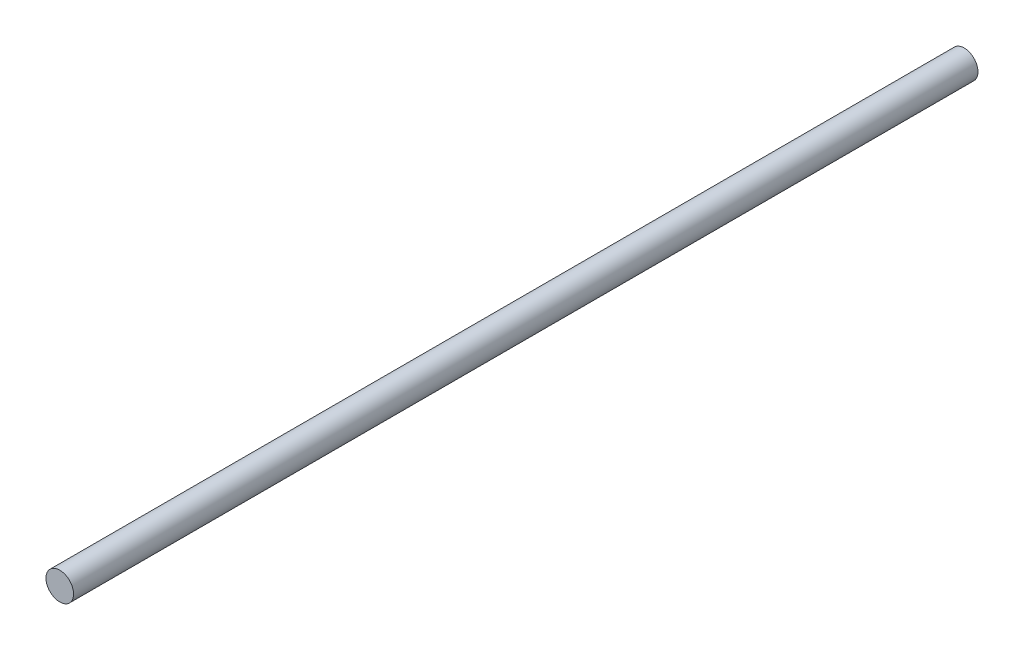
ISO-10303-21;
HEADER;
FILE_DESCRIPTION(('STEP AP214'),'2;1');
FILE_NAME('part.step','',(''),(''),'','','');
FILE_SCHEMA(('AUTOMOTIVE_DESIGN { 1 0 10303 214 1 1 1 1 }'));
ENDSEC;
DATA;
#1=APPLICATION_CONTEXT('core data for automotive mechanical design processes');
#2=APPLICATION_PROTOCOL_DEFINITION('international standard','automotive_design',2000,#1);
#3=PRODUCT_CONTEXT('',#1,'mechanical');
#4=PRODUCT('Part','Part','',(#3));
#5=PRODUCT_RELATED_PRODUCT_CATEGORY('part','',(#4));
#6=PRODUCT_DEFINITION_FORMATION('','',#4);
#7=PRODUCT_DEFINITION_CONTEXT('part definition',#1,'design');
#8=PRODUCT_DEFINITION('design','',#6,#7);
#9=PRODUCT_DEFINITION_SHAPE('','',#8);
#10=(LENGTH_UNIT() NAMED_UNIT(*) SI_UNIT(.MILLI.,.METRE.));
#11=(NAMED_UNIT(*) PLANE_ANGLE_UNIT() SI_UNIT($,.RADIAN.));
#12=(NAMED_UNIT(*) SI_UNIT($,.STERADIAN.) SOLID_ANGLE_UNIT());
#13=UNCERTAINTY_MEASURE_WITH_UNIT(LENGTH_MEASURE(1.E-05),#10,'distance_accuracy_value','');
#14=(GEOMETRIC_REPRESENTATION_CONTEXT(3) GLOBAL_UNCERTAINTY_ASSIGNED_CONTEXT((#13)) GLOBAL_UNIT_ASSIGNED_CONTEXT((#10,
#11,#12)) REPRESENTATION_CONTEXT('',''));
#15=CARTESIAN_POINT('',(0.,0.,0.));
#16=DIRECTION('',(0.,0.,1.));
#17=DIRECTION('',(1.,0.,0.));
#18=AXIS2_PLACEMENT_3D('',#15,#16,#17);
#19=CARTESIAN_POINT('',(24.,27.,82.));
#20=DIRECTION('',(0.,0.,-1.));
#21=DIRECTION('',(-1.,0.,0.));
#22=AXIS2_PLACEMENT_3D('',#19,#20,#21);
#23=CYLINDRICAL_SURFACE('',#22,1.25);
#24=CARTESIAN_POINT('',(24.,27.,82.));
#25=DIRECTION('',(0.,0.,1.));
#26=DIRECTION('',(1.,0.,0.));
#27=AXIS2_PLACEMENT_3D('',#24,#25,#26);
#28=CIRCLE('',#27,1.25);
#29=CARTESIAN_POINT('',(25.25,27.,82.));
#30=VERTEX_POINT('',#29);
#31=EDGE_CURVE('E10',#30,#30,#28,.T.);
#32=ORIENTED_EDGE('',*,*,#31,.F.);
#33=EDGE_LOOP('',(#32));
#34=FACE_BOUND('',#33,.T.);
#35=CARTESIAN_POINT('',(24.,27.,0.));
#36=DIRECTION('',(0.,0.,1.));
#37=DIRECTION('',(1.,0.,0.));
#38=AXIS2_PLACEMENT_3D('',#35,#36,#37);
#39=CIRCLE('',#38,1.25);
#40=CARTESIAN_POINT('',(25.25,27.,0.));
#41=VERTEX_POINT('',#40);
#42=EDGE_CURVE('E374',#41,#41,#39,.T.);
#43=ORIENTED_EDGE('',*,*,#42,.T.);
#44=EDGE_LOOP('',(#43));
#45=FACE_BOUND('',#44,.T.);
#46=ADVANCED_FACE('F368',(#34,#45),#23,.T.);
#47=CARTESIAN_POINT('',(24.,27.,82.));
#48=DIRECTION('',(0.,0.,1.));
#49=DIRECTION('',(1.,0.,0.));
#50=AXIS2_PLACEMENT_3D('',#47,#48,#49);
#51=PLANE('',#50);
#52=ORIENTED_EDGE('',*,*,#31,.T.);
#53=EDGE_LOOP('',(#52));
#54=FACE_BOUND('',#53,.T.);
#55=ADVANCED_FACE('F383',(#54),#51,.T.);
#56=CARTESIAN_POINT('',(24.,27.,0.));
#57=DIRECTION('',(0.,0.,1.));
#58=DIRECTION('',(1.,0.,0.));
#59=AXIS2_PLACEMENT_3D('',#56,#57,#58);
#60=PLANE('',#59);
#61=ORIENTED_EDGE('',*,*,#42,.F.);
#62=EDGE_LOOP('',(#61));
#63=FACE_BOUND('',#62,.T.);
#64=ADVANCED_FACE('F381',(#63),#60,.F.);
#65=CLOSED_SHELL('',(#46,#55,#64));
#66=MANIFOLD_SOLID_BREP('B2',#65);
#67=ADVANCED_BREP_SHAPE_REPRESENTATION('',(#18,#66),#14);
#68=SHAPE_DEFINITION_REPRESENTATION(#9,#67);
ENDSEC;
END-ISO-10303-21;
